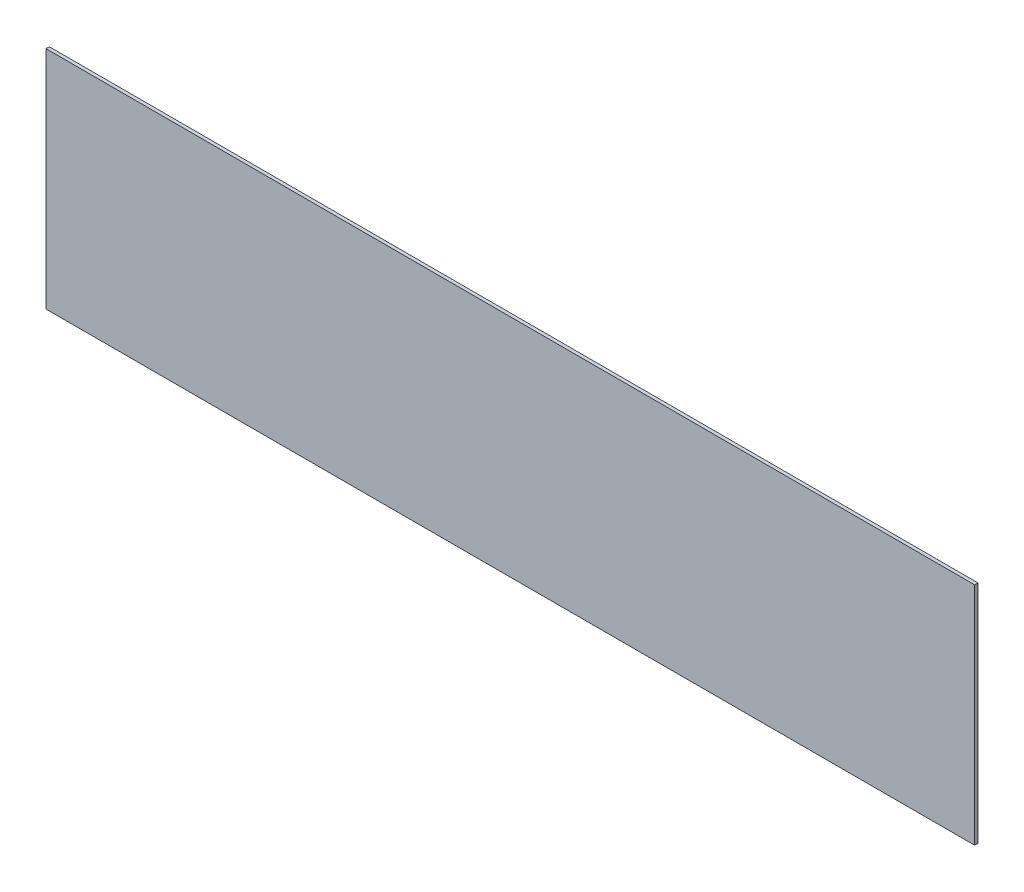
ISO-10303-21;
HEADER;
FILE_DESCRIPTION(('STEP AP214'),'2;1');
FILE_NAME('part.step','',(''),(''),'','','');
FILE_SCHEMA(('AUTOMOTIVE_DESIGN { 1 0 10303 214 1 1 1 1 }'));
ENDSEC;
DATA;
#1=APPLICATION_CONTEXT('core data for automotive mechanical design processes');
#2=APPLICATION_PROTOCOL_DEFINITION('international standard','automotive_design',2000,#1);
#3=PRODUCT_CONTEXT('',#1,'mechanical');
#4=PRODUCT('Part','Part','',(#3));
#5=PRODUCT_RELATED_PRODUCT_CATEGORY('part','',(#4));
#6=PRODUCT_DEFINITION_FORMATION('','',#4);
#7=PRODUCT_DEFINITION_CONTEXT('part definition',#1,'design');
#8=PRODUCT_DEFINITION('design','',#6,#7);
#9=PRODUCT_DEFINITION_SHAPE('','',#8);
#10=(LENGTH_UNIT() NAMED_UNIT(*) SI_UNIT(.MILLI.,.METRE.));
#11=(NAMED_UNIT(*) PLANE_ANGLE_UNIT() SI_UNIT($,.RADIAN.));
#12=(NAMED_UNIT(*) SI_UNIT($,.STERADIAN.) SOLID_ANGLE_UNIT());
#13=UNCERTAINTY_MEASURE_WITH_UNIT(LENGTH_MEASURE(1.E-05),#10,'distance_accuracy_value','');
#14=(GEOMETRIC_REPRESENTATION_CONTEXT(3) GLOBAL_UNCERTAINTY_ASSIGNED_CONTEXT((#13)) GLOBAL_UNIT_ASSIGNED_CONTEXT((#10,
#11,#12)) REPRESENTATION_CONTEXT('',''));
#15=CARTESIAN_POINT('',(0.,0.,0.));
#16=DIRECTION('',(0.,0.,1.));
#17=DIRECTION('',(1.,0.,0.));
#18=AXIS2_PLACEMENT_3D('',#15,#16,#17);
#19=CARTESIAN_POINT('',(-799.054117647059,114.150588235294,6.35));
#20=DIRECTION('',(1.,0.,0.));
#21=DIRECTION('',(0.,0.,-1.));
#22=AXIS2_PLACEMENT_3D('',#19,#20,#21);
#23=PLANE('',#22);
#24=DIRECTION('',(0.,-1.,0.));
#25=VECTOR('',#24,1.);
#26=CARTESIAN_POINT('',(-799.054117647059,114.150588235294,0.));
#27=LINE('',#26,#25);
#28=CARTESIAN_POINT('',(-799.054117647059,545.950588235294,0.));
#29=VERTEX_POINT('',#28);
#30=CARTESIAN_POINT('',(-799.054117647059,114.150588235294,0.));
#31=VERTEX_POINT('',#30);
#32=EDGE_CURVE('E102',#29,#31,#27,.T.);
#33=ORIENTED_EDGE('',*,*,#32,.T.);
#34=DIRECTION('',(0.,0.,-1.));
#35=VECTOR('',#34,1.);
#36=CARTESIAN_POINT('',(-799.054117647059,114.150588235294,6.35));
#37=LINE('',#36,#35);
#38=CARTESIAN_POINT('',(-799.054117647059,114.150588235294,6.35));
#39=VERTEX_POINT('',#38);
#40=EDGE_CURVE('E11',#39,#31,#37,.T.);
#41=ORIENTED_EDGE('',*,*,#40,.F.);
#42=DIRECTION('',(0.,-1.,0.));
#43=VECTOR('',#42,1.);
#44=CARTESIAN_POINT('',(-799.054117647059,114.150588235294,6.35));
#45=LINE('',#44,#43);
#46=CARTESIAN_POINT('',(-799.054117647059,545.950588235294,6.35));
#47=VERTEX_POINT('',#46);
#48=EDGE_CURVE('E90',#47,#39,#45,.T.);
#49=ORIENTED_EDGE('',*,*,#48,.F.);
#50=DIRECTION('',(0.,0.,-1.));
#51=VECTOR('',#50,1.);
#52=CARTESIAN_POINT('',(-799.054117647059,545.950588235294,6.35));
#53=LINE('',#52,#51);
#54=EDGE_CURVE('E98',#47,#29,#53,.T.);
#55=ORIENTED_EDGE('',*,*,#54,.T.);
#56=EDGE_LOOP('',(#33,#41,#49,#55));
#57=FACE_BOUND('',#56,.T.);
#58=ADVANCED_FACE('F39',(#57),#23,.F.);
#59=CARTESIAN_POINT('',(-799.054117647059,114.150588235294,6.35));
#60=DIRECTION('',(0.,1.,0.));
#61=DIRECTION('',(0.,0.,1.));
#62=AXIS2_PLACEMENT_3D('',#59,#60,#61);
#63=PLANE('',#62);
#64=DIRECTION('',(1.,0.,0.));
#65=VECTOR('',#64,1.);
#66=CARTESIAN_POINT('',(-799.054117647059,114.150588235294,0.));
#67=LINE('',#66,#65);
#68=CARTESIAN_POINT('',(978.945882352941,114.150588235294,0.));
#69=VERTEX_POINT('',#68);
#70=EDGE_CURVE('E94',#31,#69,#67,.T.);
#71=ORIENTED_EDGE('',*,*,#70,.T.);
#72=DIRECTION('',(0.,0.,-1.));
#73=VECTOR('',#72,1.);
#74=CARTESIAN_POINT('',(978.945882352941,114.150588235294,6.35));
#75=LINE('',#74,#73);
#76=CARTESIAN_POINT('',(978.945882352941,114.150588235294,6.35));
#77=VERTEX_POINT('',#76);
#78=EDGE_CURVE('E47',#77,#69,#75,.T.);
#79=ORIENTED_EDGE('',*,*,#78,.F.);
#80=DIRECTION('',(1.,0.,0.));
#81=VECTOR('',#80,1.);
#82=CARTESIAN_POINT('',(-799.054117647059,114.150588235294,6.35));
#83=LINE('',#82,#81);
#84=EDGE_CURVE('E85',#39,#77,#83,.T.);
#85=ORIENTED_EDGE('',*,*,#84,.F.);
#86=ORIENTED_EDGE('',*,*,#40,.T.);
#87=EDGE_LOOP('',(#71,#79,#85,#86));
#88=FACE_BOUND('',#87,.T.);
#89=ADVANCED_FACE('F93',(#88),#63,.F.);
#90=CARTESIAN_POINT('',(978.945882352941,114.150588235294,6.35));
#91=DIRECTION('',(-1.,0.,0.));
#92=DIRECTION('',(0.,-1.,0.));
#93=AXIS2_PLACEMENT_3D('',#90,#91,#92);
#94=PLANE('',#93);
#95=DIRECTION('',(0.,1.,0.));
#96=VECTOR('',#95,1.);
#97=CARTESIAN_POINT('',(978.945882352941,114.150588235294,0.));
#98=LINE('',#97,#96);
#99=CARTESIAN_POINT('',(978.945882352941,545.950588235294,0.));
#100=VERTEX_POINT('',#99);
#101=EDGE_CURVE('E72',#69,#100,#98,.T.);
#102=ORIENTED_EDGE('',*,*,#101,.T.);
#103=DIRECTION('',(0.,0.,-1.));
#104=VECTOR('',#103,1.);
#105=CARTESIAN_POINT('',(978.945882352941,545.950588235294,6.35));
#106=LINE('',#105,#104);
#107=CARTESIAN_POINT('',(978.945882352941,545.950588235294,6.35));
#108=VERTEX_POINT('',#107);
#109=EDGE_CURVE('E95',#108,#100,#106,.T.);
#110=ORIENTED_EDGE('',*,*,#109,.F.);
#111=DIRECTION('',(0.,1.,0.));
#112=VECTOR('',#111,1.);
#113=CARTESIAN_POINT('',(978.945882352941,114.150588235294,6.35));
#114=LINE('',#113,#112);
#115=EDGE_CURVE('E88',#77,#108,#114,.T.);
#116=ORIENTED_EDGE('',*,*,#115,.F.);
#117=ORIENTED_EDGE('',*,*,#78,.T.);
#118=EDGE_LOOP('',(#102,#110,#116,#117));
#119=FACE_BOUND('',#118,.T.);
#120=ADVANCED_FACE('F96',(#119),#94,.F.);
#121=CARTESIAN_POINT('',(-799.054117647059,545.950588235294,6.35));
#122=DIRECTION('',(0.,-1.,0.));
#123=DIRECTION('',(0.,0.,-1.));
#124=AXIS2_PLACEMENT_3D('',#121,#122,#123);
#125=PLANE('',#124);
#126=DIRECTION('',(-1.,0.,0.));
#127=VECTOR('',#126,1.);
#128=CARTESIAN_POINT('',(-799.054117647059,545.950588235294,0.));
#129=LINE('',#128,#127);
#130=EDGE_CURVE('E78',#100,#29,#129,.T.);
#131=ORIENTED_EDGE('',*,*,#130,.T.);
#132=ORIENTED_EDGE('',*,*,#54,.F.);
#133=DIRECTION('',(-1.,0.,0.));
#134=VECTOR('',#133,1.);
#135=CARTESIAN_POINT('',(-799.054117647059,545.950588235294,6.35));
#136=LINE('',#135,#134);
#137=EDGE_CURVE('E55',#108,#47,#136,.T.);
#138=ORIENTED_EDGE('',*,*,#137,.F.);
#139=ORIENTED_EDGE('',*,*,#109,.T.);
#140=EDGE_LOOP('',(#131,#132,#138,#139));
#141=FACE_BOUND('',#140,.T.);
#142=ADVANCED_FACE('F109',(#141),#125,.F.);
#143=CARTESIAN_POINT('',(0.,0.,6.35));
#144=DIRECTION('',(0.,0.,-1.));
#145=DIRECTION('',(-1.,0.,0.));
#146=AXIS2_PLACEMENT_3D('',#143,#144,#145);
#147=PLANE('',#146);
#148=ORIENTED_EDGE('',*,*,#48,.T.);
#149=ORIENTED_EDGE('',*,*,#84,.T.);
#150=ORIENTED_EDGE('',*,*,#115,.T.);
#151=ORIENTED_EDGE('',*,*,#137,.T.);
#152=EDGE_LOOP('',(#148,#149,#150,#151));
#153=FACE_BOUND('',#152,.T.);
#154=ADVANCED_FACE('F86',(#153),#147,.F.);
#155=CARTESIAN_POINT('',(0.,0.,0.));
#156=DIRECTION('',(0.,0.,-1.));
#157=DIRECTION('',(-1.,0.,0.));
#158=AXIS2_PLACEMENT_3D('',#155,#156,#157);
#159=PLANE('',#158);
#160=ORIENTED_EDGE('',*,*,#32,.F.);
#161=ORIENTED_EDGE('',*,*,#130,.F.);
#162=ORIENTED_EDGE('',*,*,#101,.F.);
#163=ORIENTED_EDGE('',*,*,#70,.F.);
#164=EDGE_LOOP('',(#160,#161,#162,#163));
#165=FACE_BOUND('',#164,.T.);
#166=ADVANCED_FACE('F112',(#165),#159,.T.);
#167=CLOSED_SHELL('',(#58,#89,#120,#142,#154,#166));
#168=MANIFOLD_SOLID_BREP('B2',#167);
#169=ADVANCED_BREP_SHAPE_REPRESENTATION('',(#18,#168),#14);
#170=SHAPE_DEFINITION_REPRESENTATION(#9,#169);
ENDSEC;
END-ISO-10303-21;
